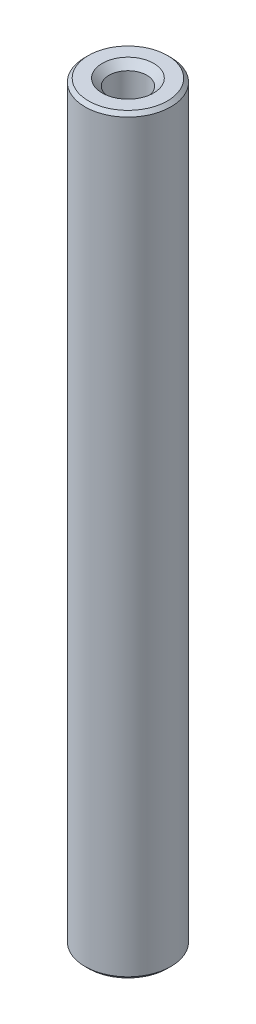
ISO-10303-21;
HEADER;
FILE_DESCRIPTION(('STEP AP214'),'2;1');
FILE_NAME('part.step','',(''),(''),'','','');
FILE_SCHEMA(('AUTOMOTIVE_DESIGN { 1 0 10303 214 1 1 1 1 }'));
ENDSEC;
DATA;
#1=APPLICATION_CONTEXT('core data for automotive mechanical design processes');
#2=APPLICATION_PROTOCOL_DEFINITION('international standard','automotive_design',2000,#1);
#3=PRODUCT_CONTEXT('',#1,'mechanical');
#4=PRODUCT('Part','Part','',(#3));
#5=PRODUCT_RELATED_PRODUCT_CATEGORY('part','',(#4));
#6=PRODUCT_DEFINITION_FORMATION('','',#4);
#7=PRODUCT_DEFINITION_CONTEXT('part definition',#1,'design');
#8=PRODUCT_DEFINITION('design','',#6,#7);
#9=PRODUCT_DEFINITION_SHAPE('','',#8);
#10=(LENGTH_UNIT() NAMED_UNIT(*) SI_UNIT(.MILLI.,.METRE.));
#11=(NAMED_UNIT(*) PLANE_ANGLE_UNIT() SI_UNIT($,.RADIAN.));
#12=(NAMED_UNIT(*) SI_UNIT($,.STERADIAN.) SOLID_ANGLE_UNIT());
#13=UNCERTAINTY_MEASURE_WITH_UNIT(LENGTH_MEASURE(1.E-05),#10,'distance_accuracy_value','');
#14=(GEOMETRIC_REPRESENTATION_CONTEXT(3) GLOBAL_UNCERTAINTY_ASSIGNED_CONTEXT((#13)) GLOBAL_UNIT_ASSIGNED_CONTEXT((#10,
#11,#12)) REPRESENTATION_CONTEXT('',''));
#15=CARTESIAN_POINT('',(0.,0.,0.));
#16=DIRECTION('',(0.,0.,1.));
#17=DIRECTION('',(1.,0.,0.));
#18=AXIS2_PLACEMENT_3D('',#15,#16,#17);
#19=CARTESIAN_POINT('',(0.,30.7999999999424,0.));
#20=DIRECTION('',(0.,1.,0.));
#21=DIRECTION('',(-1.,0.,0.));
#22=AXIS2_PLACEMENT_3D('',#19,#20,#21);
#23=CONICAL_SURFACE('',#22,1.09999999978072,1.04719755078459);
#24=CARTESIAN_POINT('',(0.,30.1649147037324,0.));
#25=VERTEX_POINT('',#24);
#26=VERTEX_LOOP('',#25);
#27=FACE_BOUND('',#26,.T.);
#28=CARTESIAN_POINT('',(0.,30.7999999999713,0.));
#29=DIRECTION('',(0.,1.,0.));
#30=DIRECTION('',(0.,0.,1.));
#31=AXIS2_PLACEMENT_3D('',#28,#29,#30);
#32=CIRCLE('',#31,1.1);
#33=CARTESIAN_POINT('',(0.,30.7999999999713,1.1));
#34=VERTEX_POINT('',#33);
#35=EDGE_CURVE('E35',#34,#34,#32,.T.);
#36=ORIENTED_EDGE('',*,*,#35,.T.);
#37=EDGE_LOOP('',(#36));
#38=FACE_BOUND('',#37,.T.);
#39=ADVANCED_FACE('F15',(#27,#38),#23,.F.);
#40=CARTESIAN_POINT('',(0.,12.9999999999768,0.));
#41=DIRECTION('',(0.,-1.,0.));
#42=DIRECTION('',(1.,0.,0.));
#43=AXIS2_PLACEMENT_3D('',#40,#41,#42);
#44=CONICAL_SURFACE('',#43,1.09999999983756,1.04719755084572);
#45=CARTESIAN_POINT('',(0.,13.63508529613,0.));
#46=VERTEX_POINT('',#45);
#47=VERTEX_LOOP('',#46);
#48=FACE_BOUND('',#47,.T.);
#49=CARTESIAN_POINT('',(0.,12.9999999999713,0.));
#50=DIRECTION('',(0.,-1.,0.));
#51=DIRECTION('',(0.,0.,-1.));
#52=AXIS2_PLACEMENT_3D('',#49,#50,#51);
#53=CIRCLE('',#52,1.1);
#54=CARTESIAN_POINT('',(0.,12.9999999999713,-1.1));
#55=VERTEX_POINT('',#54);
#56=EDGE_CURVE('E37',#55,#55,#53,.T.);
#57=ORIENTED_EDGE('',*,*,#56,.T.);
#58=EDGE_LOOP('',(#57));
#59=FACE_BOUND('',#58,.T.);
#60=ADVANCED_FACE('F32',(#48,#59),#44,.F.);
#61=CARTESIAN_POINT('',(0.,35.7999999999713,0.));
#62=DIRECTION('',(0.,1.,0.));
#63=DIRECTION('',(0.,0.,1.));
#64=AXIS2_PLACEMENT_3D('',#61,#62,#63);
#65=CYLINDRICAL_SURFACE('',#64,1.1);
#66=ORIENTED_EDGE('',*,*,#35,.F.);
#67=EDGE_LOOP('',(#66));
#68=FACE_BOUND('',#67,.T.);
#69=CARTESIAN_POINT('',(0.,43.3999999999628,0.));
#70=DIRECTION('',(0.,1.,0.));
#71=DIRECTION('',(0.,0.,1.));
#72=AXIS2_PLACEMENT_3D('',#69,#70,#71);
#73=CIRCLE('',#72,1.10000000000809);
#74=CARTESIAN_POINT('',(0.,43.3999999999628,1.10000000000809));
#75=VERTEX_POINT('',#74);
#76=EDGE_CURVE('E40',#75,#75,#73,.T.);
#77=ORIENTED_EDGE('',*,*,#76,.T.);
#78=EDGE_LOOP('',(#77));
#79=FACE_BOUND('',#78,.T.);
#80=ADVANCED_FACE('F139',(#68,#79),#65,.F.);
#81=CARTESIAN_POINT('',(0.,7.99999999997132,0.));
#82=DIRECTION('',(0.,-1.,0.));
#83=DIRECTION('',(0.,0.,-1.));
#84=AXIS2_PLACEMENT_3D('',#81,#82,#83);
#85=CYLINDRICAL_SURFACE('',#84,1.1);
#86=ORIENTED_EDGE('',*,*,#56,.F.);
#87=EDGE_LOOP('',(#86));
#88=FACE_BOUND('',#87,.T.);
#89=CARTESIAN_POINT('',(0.,0.400000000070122,0.));
#90=DIRECTION('',(0.,-1.,0.));
#91=DIRECTION('',(0.,0.,-1.));
#92=AXIS2_PLACEMENT_3D('',#89,#90,#91);
#93=CIRCLE('',#92,1.09999999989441);
#94=CARTESIAN_POINT('',(0.,0.400000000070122,-1.09999999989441));
#95=VERTEX_POINT('',#94);
#96=EDGE_CURVE('E54',#95,#95,#93,.T.);
#97=ORIENTED_EDGE('',*,*,#96,.T.);
#98=EDGE_LOOP('',(#97));
#99=FACE_BOUND('',#98,.T.);
#100=ADVANCED_FACE('F131',(#88,#99),#85,.F.);
#101=CARTESIAN_POINT('',(0.,43.7999999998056,0.));
#102=DIRECTION('',(0.,1.,0.));
#103=DIRECTION('',(0.,0.,1.));
#104=AXIS2_PLACEMENT_3D('',#101,#102,#103);
#105=CONICAL_SURFACE('',#104,1.49999999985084,0.785398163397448);
#106=ORIENTED_EDGE('',*,*,#76,.F.);
#107=EDGE_LOOP('',(#106));
#108=FACE_BOUND('',#107,.T.);
#109=CARTESIAN_POINT('',(0.,43.7999999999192,0.));
#110=DIRECTION('',(0.,1.,0.));
#111=DIRECTION('',(0.,0.,1.));
#112=AXIS2_PLACEMENT_3D('',#109,#110,#111);
#113=CIRCLE('',#112,1.49999999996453);
#114=CARTESIAN_POINT('',(0.,43.7999999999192,1.49999999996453));
#115=VERTEX_POINT('',#114);
#116=EDGE_CURVE('E18',#115,#115,#113,.F.);
#117=ORIENTED_EDGE('',*,*,#116,.F.);
#118=EDGE_LOOP('',(#117));
#119=FACE_BOUND('',#118,.T.);
#120=ADVANCED_FACE('F123',(#108,#119),#105,.F.);
#121=CARTESIAN_POINT('',(0.,-5.6843418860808E-11,0.));
#122=DIRECTION('',(0.,-1.,0.));
#123=DIRECTION('',(0.,0.,-1.));
#124=AXIS2_PLACEMENT_3D('',#121,#122,#123);
#125=CONICAL_SURFACE('',#124,1.50000000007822,0.785398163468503);
#126=ORIENTED_EDGE('',*,*,#96,.F.);
#127=EDGE_LOOP('',(#126));
#128=FACE_BOUND('',#127,.T.);
#129=CARTESIAN_POINT('',(0.,-5.6843418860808E-11,0.));
#130=DIRECTION('',(0.,-1.,0.));
#131=DIRECTION('',(0.,0.,-1.));
#132=AXIS2_PLACEMENT_3D('',#129,#130,#131);
#133=CIRCLE('',#132,1.50000000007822);
#134=CARTESIAN_POINT('',(0.,-5.6843418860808E-11,-1.50000000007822));
#135=VERTEX_POINT('',#134);
#136=EDGE_CURVE('E49',#135,#135,#133,.F.);
#137=ORIENTED_EDGE('',*,*,#136,.F.);
#138=EDGE_LOOP('',(#137));
#139=FACE_BOUND('',#138,.T.);
#140=ADVANCED_FACE('F86',(#128,#139),#125,.F.);
#141=CARTESIAN_POINT('',(0.941102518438,43.7999999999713,-3.1025772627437));
#142=DIRECTION('',(0.,1.,0.));
#143=DIRECTION('',(0.,0.,1.));
#144=AXIS2_PLACEMENT_3D('',#141,#142,#143);
#145=PLANE('',#144);
#146=CARTESIAN_POINT('',(0.,43.7999999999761,0.));
#147=DIRECTION('',(0.,-1.,0.));
#148=DIRECTION('',(0.,0.,-1.));
#149=AXIS2_PLACEMENT_3D('',#146,#147,#148);
#150=CIRCLE('',#149,2.29999999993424);
#151=CARTESIAN_POINT('',(0.,43.7999999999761,-2.29999999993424));
#152=VERTEX_POINT('',#151);
#153=EDGE_CURVE('E47',#152,#152,#150,.T.);
#154=ORIENTED_EDGE('',*,*,#153,.F.);
#155=EDGE_LOOP('',(#154));
#156=FACE_BOUND('',#155,.T.);
#157=ORIENTED_EDGE('',*,*,#116,.T.);
#158=EDGE_LOOP('',(#157));
#159=FACE_BOUND('',#158,.T.);
#160=ADVANCED_FACE('F77',(#156,#159),#145,.T.);
#161=CARTESIAN_POINT('',(0.941102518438,-2.86784485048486E-11,3.1025772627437));
#162=DIRECTION('',(0.,-1.,0.));
#163=DIRECTION('',(0.,0.,-1.));
#164=AXIS2_PLACEMENT_3D('',#161,#162,#163);
#165=PLANE('',#164);
#166=CARTESIAN_POINT('',(0.,5.68466172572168E-11,0.));
#167=DIRECTION('',(0.,1.,0.));
#168=DIRECTION('',(-1.,0.,0.));
#169=AXIS2_PLACEMENT_3D('',#166,#167,#168);
#170=CIRCLE('',#169,2.30000000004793);
#171=CARTESIAN_POINT('',(-2.30000000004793,5.6843412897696E-11,0.));
#172=VERTEX_POINT('',#171);
#173=EDGE_CURVE('E44',#172,#172,#170,.T.);
#174=ORIENTED_EDGE('',*,*,#173,.F.);
#175=EDGE_LOOP('',(#174));
#176=FACE_BOUND('',#175,.T.);
#177=ORIENTED_EDGE('',*,*,#136,.T.);
#178=EDGE_LOOP('',(#177));
#179=FACE_BOUND('',#178,.T.);
#180=ADVANCED_FACE('F75',(#176,#179),#165,.T.);
#181=CARTESIAN_POINT('',(0.,43.5999999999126,0.));
#182=DIRECTION('',(0.,-1.,0.));
#183=DIRECTION('',(0.,0.,-1.));
#184=AXIS2_PLACEMENT_3D('',#181,#182,#183);
#185=CONICAL_SURFACE('',#184,2.49999999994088,0.78539816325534);
#186=CARTESIAN_POINT('',(0.,43.5999999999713,0.));
#187=DIRECTION('',(0.,1.,0.));
#188=DIRECTION('',(0.,0.,1.));
#189=AXIS2_PLACEMENT_3D('',#186,#187,#188);
#190=CIRCLE('',#189,2.5);
#191=CARTESIAN_POINT('',(0.,43.5999999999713,2.5));
#192=VERTEX_POINT('',#191);
#193=EDGE_CURVE('E9',#192,#192,#190,.F.);
#194=ORIENTED_EDGE('',*,*,#193,.F.);
#195=EDGE_LOOP('',(#194));
#196=FACE_BOUND('',#195,.T.);
#197=ORIENTED_EDGE('',*,*,#153,.T.);
#198=EDGE_LOOP('',(#197));
#199=FACE_BOUND('',#198,.T.);
#200=ADVANCED_FACE('F71',(#196,#199),#185,.T.);
#201=CARTESIAN_POINT('',(0.,0.199999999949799,0.));
#202=DIRECTION('',(0.,1.,0.));
#203=DIRECTION('',(-1.,0.,0.));
#204=AXIS2_PLACEMENT_3D('',#201,#202,#203);
#205=CONICAL_SURFACE('',#204,2.49999999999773,0.785398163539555);
#206=CARTESIAN_POINT('',(0.,0.199999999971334,0.));
#207=DIRECTION('',(0.,1.,0.));
#208=DIRECTION('',(0.,0.,1.));
#209=AXIS2_PLACEMENT_3D('',#206,#207,#208);
#210=CIRCLE('',#209,2.5);
#211=CARTESIAN_POINT('',(0.,0.199999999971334,2.5));
#212=VERTEX_POINT('',#211);
#213=EDGE_CURVE('E24',#212,#212,#210,.T.);
#214=ORIENTED_EDGE('',*,*,#213,.F.);
#215=EDGE_LOOP('',(#214));
#216=FACE_BOUND('',#215,.T.);
#217=ORIENTED_EDGE('',*,*,#173,.T.);
#218=EDGE_LOOP('',(#217));
#219=FACE_BOUND('',#218,.T.);
#220=ADVANCED_FACE('F68',(#216,#219),#205,.T.);
#221=CARTESIAN_POINT('',(0.,42.4999999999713,0.));
#222=DIRECTION('',(0.,1.,0.));
#223=DIRECTION('',(0.,0.,1.));
#224=AXIS2_PLACEMENT_3D('',#221,#222,#223);
#225=CYLINDRICAL_SURFACE('',#224,2.5);
#226=ORIENTED_EDGE('',*,*,#193,.T.);
#227=EDGE_LOOP('',(#226));
#228=FACE_BOUND('',#227,.T.);
#229=ORIENTED_EDGE('',*,*,#213,.T.);
#230=EDGE_LOOP('',(#229));
#231=FACE_BOUND('',#230,.T.);
#232=ADVANCED_FACE('F66',(#228,#231),#225,.T.);
#233=CLOSED_SHELL('',(#39,#60,#80,#100,#120,#140,#160,#180,#200,#220,#232));
#234=MANIFOLD_SOLID_BREP('B1',#233);
#235=ADVANCED_BREP_SHAPE_REPRESENTATION('',(#18,#234),#14);
#236=SHAPE_DEFINITION_REPRESENTATION(#9,#235);
ENDSEC;
END-ISO-10303-21;
